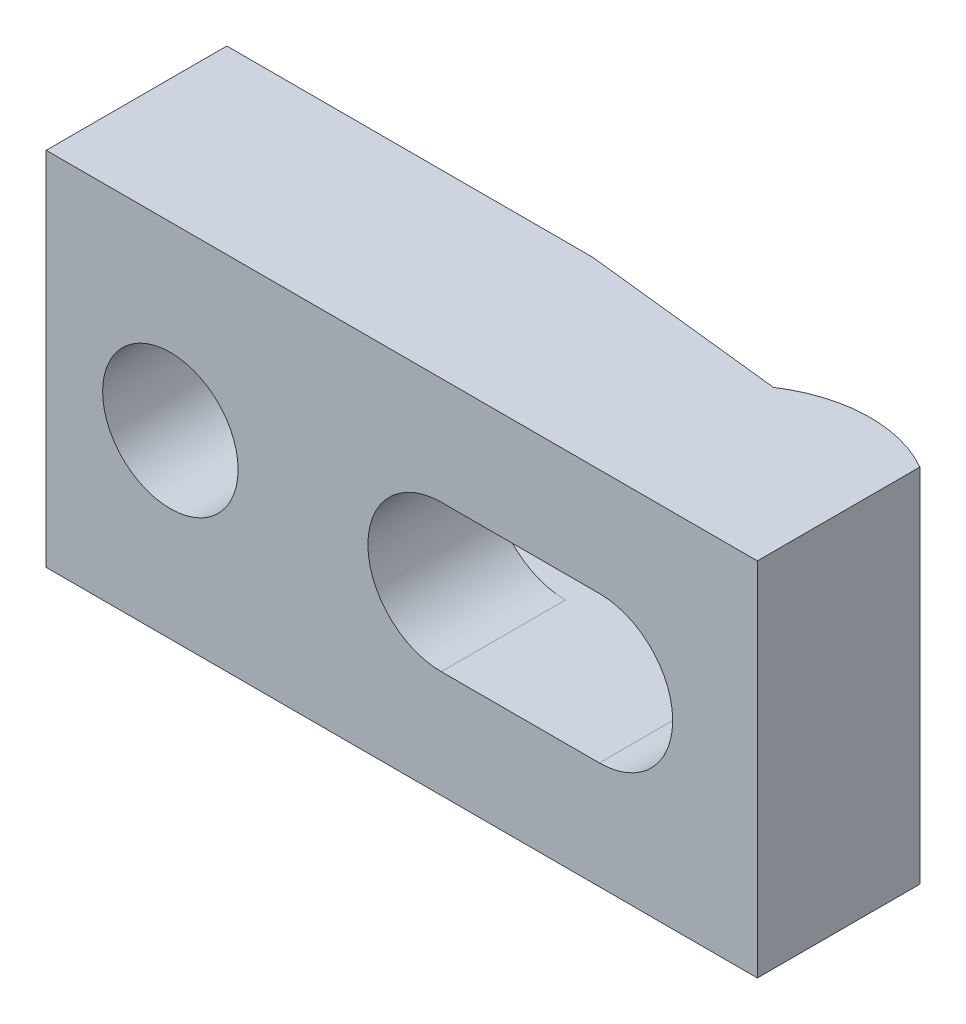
ISO-10303-21;
HEADER;
FILE_DESCRIPTION(('STEP AP214'),'2;1');
FILE_NAME('part.step','',(''),(''),'','','');
FILE_SCHEMA(('AUTOMOTIVE_DESIGN { 1 0 10303 214 1 1 1 1 }'));
ENDSEC;
DATA;
#1=APPLICATION_CONTEXT('core data for automotive mechanical design processes');
#2=APPLICATION_PROTOCOL_DEFINITION('international standard','automotive_design',2000,#1);
#3=PRODUCT_CONTEXT('',#1,'mechanical');
#4=PRODUCT('Part','Part','',(#3));
#5=PRODUCT_RELATED_PRODUCT_CATEGORY('part','',(#4));
#6=PRODUCT_DEFINITION_FORMATION('','',#4);
#7=PRODUCT_DEFINITION_CONTEXT('part definition',#1,'design');
#8=PRODUCT_DEFINITION('design','',#6,#7);
#9=PRODUCT_DEFINITION_SHAPE('','',#8);
#10=(LENGTH_UNIT() NAMED_UNIT(*) SI_UNIT(.MILLI.,.METRE.));
#11=(NAMED_UNIT(*) PLANE_ANGLE_UNIT() SI_UNIT($,.RADIAN.));
#12=(NAMED_UNIT(*) SI_UNIT($,.STERADIAN.) SOLID_ANGLE_UNIT());
#13=UNCERTAINTY_MEASURE_WITH_UNIT(LENGTH_MEASURE(1.E-05),#10,'distance_accuracy_value','');
#14=(GEOMETRIC_REPRESENTATION_CONTEXT(3) GLOBAL_UNCERTAINTY_ASSIGNED_CONTEXT((#13)) GLOBAL_UNIT_ASSIGNED_CONTEXT((#10,
#11,#12)) REPRESENTATION_CONTEXT('',''));
#15=CARTESIAN_POINT('',(0.,0.,0.));
#16=DIRECTION('',(0.,0.,1.));
#17=DIRECTION('',(1.,0.,0.));
#18=AXIS2_PLACEMENT_3D('',#15,#16,#17);
#19=CARTESIAN_POINT('',(-49.,16.,0.));
#20=DIRECTION('',(0.,0.,-1.));
#21=DIRECTION('',(-1.,0.,0.));
#22=AXIS2_PLACEMENT_3D('',#19,#20,#21);
#23=PLANE('',#22);
#24=DIRECTION('',(0.,-1.,0.));
#25=VECTOR('',#24,1.);
#26=CARTESIAN_POINT('',(-16.6,16.,0.));
#27=LINE('',#26,#25);
#28=CARTESIAN_POINT('',(-16.6,16.,0.));
#29=VERTEX_POINT('',#28);
#30=CARTESIAN_POINT('',(-16.6,6.5,0.));
#31=VERTEX_POINT('',#30);
#32=EDGE_CURVE('E143',#29,#31,#27,.T.);
#33=ORIENTED_EDGE('',*,*,#32,.T.);
#34=DIRECTION('',(-1.,0.,0.));
#35=VECTOR('',#34,1.);
#36=CARTESIAN_POINT('',(-6.,6.5,0.));
#37=LINE('',#36,#35);
#38=CARTESIAN_POINT('',(-49.,6.5,0.));
#39=VERTEX_POINT('',#38);
#40=EDGE_CURVE('E137',#31,#39,#37,.T.);
#41=ORIENTED_EDGE('',*,*,#40,.T.);
#42=DIRECTION('',(0.,-1.,0.));
#43=VECTOR('',#42,1.);
#44=CARTESIAN_POINT('',(-49.,16.,0.));
#45=LINE('',#44,#43);
#46=CARTESIAN_POINT('',(-49.,16.,0.));
#47=VERTEX_POINT('',#46);
#48=EDGE_CURVE('E144',#47,#39,#45,.T.);
#49=ORIENTED_EDGE('',*,*,#48,.F.);
#50=DIRECTION('',(1.,0.,0.));
#51=VECTOR('',#50,1.);
#52=CARTESIAN_POINT('',(-49.,16.,0.));
#53=LINE('',#52,#51);
#54=EDGE_CURVE('E173',#47,#29,#53,.T.);
#55=ORIENTED_EDGE('',*,*,#54,.T.);
#56=EDGE_LOOP('',(#33,#41,#49,#55));
#57=FACE_BOUND('',#56,.T.);
#58=ADVANCED_FACE('F14',(#57),#23,.T.);
#59=CARTESIAN_POINT('',(1.4,16.,1.97802414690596));
#60=DIRECTION('',(-0.109232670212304,0.,0.99401620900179));
#61=DIRECTION('',(0.99401620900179,0.,0.109232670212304));
#62=AXIS2_PLACEMENT_3D('',#59,#60,#61);
#63=PLANE('',#62);
#64=DIRECTION('',(-0.99401620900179,0.,-0.109232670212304));
#65=VECTOR('',#64,1.);
#66=CARTESIAN_POINT('',(1.4,6.5,1.97802414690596));
#67=LINE('',#66,#65);
#68=CARTESIAN_POINT('',(0.,6.5,1.82417782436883));
#69=VERTEX_POINT('',#68);
#70=EDGE_CURVE('E23',#69,#31,#67,.T.);
#71=ORIENTED_EDGE('',*,*,#70,.T.);
#72=ORIENTED_EDGE('',*,*,#32,.F.);
#73=DIRECTION('',(-0.99401620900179,0.,-0.109232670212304));
#74=VECTOR('',#73,1.);
#75=CARTESIAN_POINT('',(1.4,16.,1.97802414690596));
#76=LINE('',#75,#74);
#77=CARTESIAN_POINT('',(1.4,16.,1.97802414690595));
#78=VERTEX_POINT('',#77);
#79=EDGE_CURVE('E178',#78,#29,#76,.T.);
#80=ORIENTED_EDGE('',*,*,#79,.F.);
#81=DIRECTION('',(0.,-1.,0.));
#82=VECTOR('',#81,1.);
#83=CARTESIAN_POINT('',(1.4,16.,1.97802414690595));
#84=LINE('',#83,#82);
#85=CARTESIAN_POINT('',(1.4,6.34744042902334,1.97802414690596));
#86=VERTEX_POINT('',#85);
#87=EDGE_CURVE('E152',#78,#86,#84,.T.);
#88=ORIENTED_EDGE('',*,*,#87,.T.);
#89=CARTESIAN_POINT('',(0.,0.,1.82417782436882));
#90=DIRECTION('',(-0.109232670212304,0.,0.99401620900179));
#91=DIRECTION('',(-0.99401620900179,0.,-0.109232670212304));
#92=AXIS2_PLACEMENT_3D('',#89,#90,#91);
#93=ELLIPSE('',#92,6.53912877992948,6.5);
#94=EDGE_CURVE('E9',#69,#86,#93,.F.);
#95=ORIENTED_EDGE('',*,*,#94,.F.);
#96=EDGE_LOOP('',(#71,#72,#80,#88,#95));
#97=FACE_BOUND('',#96,.T.);
#98=ADVANCED_FACE('F160',(#97),#63,.F.);
#99=CARTESIAN_POINT('',(-49.,16.,16.));
#100=DIRECTION('',(-1.,0.,0.));
#101=DIRECTION('',(0.,0.,1.));
#102=AXIS2_PLACEMENT_3D('',#99,#100,#101);
#103=PLANE('',#102);
#104=ORIENTED_EDGE('',*,*,#48,.T.);
#105=DIRECTION('',(0.,0.,1.));
#106=VECTOR('',#105,1.);
#107=CARTESIAN_POINT('',(-49.,6.5,16.));
#108=LINE('',#107,#106);
#109=CARTESIAN_POINT('',(-49.,6.5,5.));
#110=VERTEX_POINT('',#109);
#111=EDGE_CURVE('E168',#39,#110,#108,.T.);
#112=ORIENTED_EDGE('',*,*,#111,.T.);
#113=DIRECTION('',(0.,-1.,0.));
#114=VECTOR('',#113,1.);
#115=CARTESIAN_POINT('',(-49.,16.,5.));
#116=LINE('',#115,#114);
#117=CARTESIAN_POINT('',(-49.,-6.5,5.));
#118=VERTEX_POINT('',#117);
#119=EDGE_CURVE('E279',#110,#118,#116,.T.);
#120=ORIENTED_EDGE('',*,*,#119,.T.);
#121=DIRECTION('',(0.,0.,1.));
#122=VECTOR('',#121,1.);
#123=CARTESIAN_POINT('',(-49.,-6.5,16.));
#124=LINE('',#123,#122);
#125=CARTESIAN_POINT('',(-49.,-6.5,0.));
#126=VERTEX_POINT('',#125);
#127=EDGE_CURVE('E278',#126,#118,#124,.T.);
#128=ORIENTED_EDGE('',*,*,#127,.F.);
#129=CARTESIAN_POINT('',(-49.,-16.,0.));
#130=VERTEX_POINT('',#129);
#131=EDGE_CURVE('E136',#126,#130,#45,.T.);
#132=ORIENTED_EDGE('',*,*,#131,.T.);
#133=DIRECTION('',(0.,0.,-1.));
#134=VECTOR('',#133,1.);
#135=CARTESIAN_POINT('',(-49.,-16.,16.));
#136=LINE('',#135,#134);
#137=CARTESIAN_POINT('',(-49.,-16.,16.));
#138=VERTEX_POINT('',#137);
#139=EDGE_CURVE('E204',#138,#130,#136,.T.);
#140=ORIENTED_EDGE('',*,*,#139,.F.);
#141=DIRECTION('',(0.,-1.,0.));
#142=VECTOR('',#141,1.);
#143=CARTESIAN_POINT('',(-49.,16.,16.));
#144=LINE('',#143,#142);
#145=CARTESIAN_POINT('',(-49.,16.,16.));
#146=VERTEX_POINT('',#145);
#147=EDGE_CURVE('E196',#146,#138,#144,.T.);
#148=ORIENTED_EDGE('',*,*,#147,.F.);
#149=DIRECTION('',(0.,0.,-1.));
#150=VECTOR('',#149,1.);
#151=CARTESIAN_POINT('',(-49.,16.,16.));
#152=LINE('',#151,#150);
#153=EDGE_CURVE('E179',#146,#47,#152,.T.);
#154=ORIENTED_EDGE('',*,*,#153,.T.);
#155=EDGE_LOOP('',(#104,#112,#120,#128,#132,#140,#148,#154));
#156=FACE_BOUND('',#155,.T.);
#157=ADVANCED_FACE('F242',(#156),#103,.T.);
#158=CARTESIAN_POINT('',(-14.,0.,16.));
#159=DIRECTION('',(0.,0.,-1.));
#160=DIRECTION('',(-1.,0.,0.));
#161=AXIS2_PLACEMENT_3D('',#158,#159,#160);
#162=CYLINDRICAL_SURFACE('',#161,6.5);
#163=DIRECTION('',(0.,0.,-1.));
#164=VECTOR('',#163,1.);
#165=CARTESIAN_POINT('',(-14.,-6.5,16.));
#166=LINE('',#165,#164);
#167=CARTESIAN_POINT('',(-14.,-6.5,16.));
#168=VERTEX_POINT('',#167);
#169=CARTESIAN_POINT('',(-14.,-6.5,5.));
#170=VERTEX_POINT('',#169);
#171=EDGE_CURVE('E302',#168,#170,#166,.T.);
#172=ORIENTED_EDGE('',*,*,#171,.T.);
#173=CARTESIAN_POINT('',(-14.,0.,5.));
#174=DIRECTION('',(0.,0.,-1.));
#175=DIRECTION('',(-1.,0.,0.));
#176=AXIS2_PLACEMENT_3D('',#173,#174,#175);
#177=CIRCLE('',#176,6.5);
#178=CARTESIAN_POINT('',(-14.,6.5,5.));
#179=VERTEX_POINT('',#178);
#180=EDGE_CURVE('E285',#170,#179,#177,.T.);
#181=ORIENTED_EDGE('',*,*,#180,.T.);
#182=DIRECTION('',(0.,0.,-1.));
#183=VECTOR('',#182,1.);
#184=CARTESIAN_POINT('',(-14.,6.5,16.));
#185=LINE('',#184,#183);
#186=CARTESIAN_POINT('',(-14.,6.5,16.));
#187=VERTEX_POINT('',#186);
#188=EDGE_CURVE('E303',#187,#179,#185,.T.);
#189=ORIENTED_EDGE('',*,*,#188,.F.);
#190=CARTESIAN_POINT('',(-14.,0.,16.));
#191=DIRECTION('',(0.,0.,1.));
#192=DIRECTION('',(1.,0.,0.));
#193=AXIS2_PLACEMENT_3D('',#190,#191,#192);
#194=CIRCLE('',#193,6.5);
#195=EDGE_CURVE('E40',#187,#168,#194,.T.);
#196=ORIENTED_EDGE('',*,*,#195,.T.);
#197=EDGE_LOOP('',(#172,#181,#189,#196));
#198=FACE_BOUND('',#197,.T.);
#199=ADVANCED_FACE('F239',(#198),#162,.F.);
#200=CARTESIAN_POINT('',(-38.,0.,16.));
#201=DIRECTION('',(0.,0.,-1.));
#202=DIRECTION('',(-1.,0.,0.));
#203=AXIS2_PLACEMENT_3D('',#200,#201,#202);
#204=CYLINDRICAL_SURFACE('',#203,6.);
#205=CARTESIAN_POINT('',(-38.,0.,16.));
#206=DIRECTION('',(0.,0.,1.));
#207=DIRECTION('',(1.,0.,0.));
#208=AXIS2_PLACEMENT_3D('',#205,#206,#207);
#209=CIRCLE('',#208,6.);
#210=CARTESIAN_POINT('',(-32.,0.,16.));
#211=VERTEX_POINT('',#210);
#212=EDGE_CURVE('E283',#211,#211,#209,.T.);
#213=ORIENTED_EDGE('',*,*,#212,.T.);
#214=EDGE_LOOP('',(#213));
#215=FACE_BOUND('',#214,.T.);
#216=CARTESIAN_POINT('',(-38.,0.,5.));
#217=DIRECTION('',(0.,0.,-1.));
#218=DIRECTION('',(-1.,0.,0.));
#219=AXIS2_PLACEMENT_3D('',#216,#217,#218);
#220=CIRCLE('',#219,6.);
#221=CARTESIAN_POINT('',(-44.,0.,5.));
#222=VERTEX_POINT('',#221);
#223=EDGE_CURVE('E18',#222,#222,#220,.T.);
#224=ORIENTED_EDGE('',*,*,#223,.T.);
#225=EDGE_LOOP('',(#224));
#226=FACE_BOUND('',#225,.T.);
#227=ADVANCED_FACE('F234',(#215,#226),#204,.F.);
#228=CARTESIAN_POINT('',(14.,16.,16.));
#229=DIRECTION('',(0.,0.,1.));
#230=DIRECTION('',(1.,0.,0.));
#231=AXIS2_PLACEMENT_3D('',#228,#229,#230);
#232=PLANE('',#231);
#233=DIRECTION('',(1.,0.,0.));
#234=VECTOR('',#233,1.);
#235=CARTESIAN_POINT('',(-14.,6.5,16.));
#236=LINE('',#235,#234);
#237=CARTESIAN_POINT('',(0.,6.5,16.));
#238=VERTEX_POINT('',#237);
#239=EDGE_CURVE('E296',#187,#238,#236,.T.);
#240=ORIENTED_EDGE('',*,*,#239,.T.);
#241=CARTESIAN_POINT('',(0.,0.,16.));
#242=DIRECTION('',(0.,0.,1.));
#243=DIRECTION('',(1.,0.,0.));
#244=AXIS2_PLACEMENT_3D('',#241,#242,#243);
#245=CIRCLE('',#244,6.5);
#246=CARTESIAN_POINT('',(0.,-6.5,16.));
#247=VERTEX_POINT('',#246);
#248=EDGE_CURVE('E291',#247,#238,#245,.T.);
#249=ORIENTED_EDGE('',*,*,#248,.F.);
#250=DIRECTION('',(-1.,0.,0.));
#251=VECTOR('',#250,1.);
#252=CARTESIAN_POINT('',(0.,-6.5,16.));
#253=LINE('',#252,#251);
#254=EDGE_CURVE('E292',#247,#168,#253,.T.);
#255=ORIENTED_EDGE('',*,*,#254,.T.);
#256=ORIENTED_EDGE('',*,*,#195,.F.);
#257=EDGE_LOOP('',(#240,#249,#255,#256));
#258=FACE_BOUND('',#257,.T.);
#259=DIRECTION('',(0.,-1.,0.));
#260=VECTOR('',#259,1.);
#261=CARTESIAN_POINT('',(14.,16.,16.));
#262=LINE('',#261,#260);
#263=CARTESIAN_POINT('',(14.,16.,16.));
#264=VERTEX_POINT('',#263);
#265=CARTESIAN_POINT('',(14.,-16.,16.));
#266=VERTEX_POINT('',#265);
#267=EDGE_CURVE('E128',#264,#266,#262,.T.);
#268=ORIENTED_EDGE('',*,*,#267,.F.);
#269=DIRECTION('',(-1.,0.,0.));
#270=VECTOR('',#269,1.);
#271=CARTESIAN_POINT('',(14.,16.,16.));
#272=LINE('',#271,#270);
#273=EDGE_CURVE('E193',#264,#146,#272,.T.);
#274=ORIENTED_EDGE('',*,*,#273,.T.);
#275=ORIENTED_EDGE('',*,*,#147,.T.);
#276=DIRECTION('',(-1.,0.,0.));
#277=VECTOR('',#276,1.);
#278=CARTESIAN_POINT('',(14.,-16.,16.));
#279=LINE('',#278,#277);
#280=EDGE_CURVE('E202',#266,#138,#279,.T.);
#281=ORIENTED_EDGE('',*,*,#280,.F.);
#282=EDGE_LOOP('',(#268,#274,#275,#281));
#283=FACE_BOUND('',#282,.T.);
#284=ORIENTED_EDGE('',*,*,#212,.F.);
#285=EDGE_LOOP('',(#284));
#286=FACE_BOUND('',#285,.T.);
#287=ADVANCED_FACE('F250',(#258,#283,#286),#232,.T.);
#288=DIRECTION('',(-1.,0.,0.));
#289=VECTOR('',#288,1.);
#290=CARTESIAN_POINT('',(-6.,-6.5,0.));
#291=LINE('',#290,#289);
#292=CARTESIAN_POINT('',(-16.6,-6.5,0.));
#293=VERTEX_POINT('',#292);
#294=EDGE_CURVE('E120',#293,#126,#291,.T.);
#295=ORIENTED_EDGE('',*,*,#294,.F.);
#296=CARTESIAN_POINT('',(-16.6,-16.,0.));
#297=VERTEX_POINT('',#296);
#298=EDGE_CURVE('E134',#293,#297,#27,.T.);
#299=ORIENTED_EDGE('',*,*,#298,.T.);
#300=DIRECTION('',(1.,0.,0.));
#301=VECTOR('',#300,1.);
#302=CARTESIAN_POINT('',(-49.,-16.,0.));
#303=LINE('',#302,#301);
#304=EDGE_CURVE('E208',#130,#297,#303,.T.);
#305=ORIENTED_EDGE('',*,*,#304,.F.);
#306=ORIENTED_EDGE('',*,*,#131,.F.);
#307=EDGE_LOOP('',(#295,#299,#305,#306));
#308=FACE_BOUND('',#307,.T.);
#309=ADVANCED_FACE('F132',(#308),#23,.T.);
#310=CARTESIAN_POINT('',(8.,16.,12.));
#311=DIRECTION('',(0.,-1.,0.));
#312=DIRECTION('',(0.,0.,-1.));
#313=AXIS2_PLACEMENT_3D('',#310,#311,#312);
#314=CYLINDRICAL_SURFACE('',#313,12.);
#315=CARTESIAN_POINT('',(0.0671522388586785,6.49965311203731,2.99611603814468));
#316=CARTESIAN_POINT('',(0.215826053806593,6.49812745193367,2.86508334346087));
#317=CARTESIAN_POINT('',(0.367816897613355,6.49144366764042,2.73775770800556));
#318=CARTESIAN_POINT('',(0.677462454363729,6.46646476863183,2.49108542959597));
#319=CARTESIAN_POINT('',(0.835122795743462,6.44815779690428,2.37174707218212));
#320=CARTESIAN_POINT('',(1.15559960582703,6.39851589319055,2.14133058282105));
#321=CARTESIAN_POINT('',(1.31843727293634,6.36711856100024,2.03029506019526));
#322=CARTESIAN_POINT('',(1.64694286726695,6.29015289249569,1.81781457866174));
#323=CARTESIAN_POINT('',(1.81260983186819,6.24458928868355,1.71636643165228));
#324=CARTESIAN_POINT('',(2.1461537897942,6.13798685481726,1.52288627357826));
#325=CARTESIAN_POINT('',(2.31403814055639,6.07684265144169,1.43092462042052));
#326=CARTESIAN_POINT('',(2.64874527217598,5.93859661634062,1.25757965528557));
#327=CARTESIAN_POINT('',(2.81556793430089,5.86149303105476,1.17619750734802));
#328=CARTESIAN_POINT('',(3.14526201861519,5.69136404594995,1.0243744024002));
#329=CARTESIAN_POINT('',(3.30814444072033,5.59839075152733,0.953899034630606));
#330=CARTESIAN_POINT('',(3.62811472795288,5.39653120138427,0.823396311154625));
#331=CARTESIAN_POINT('',(3.78520346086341,5.28764734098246,0.763367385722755));
#332=CARTESIAN_POINT('',(4.07177999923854,5.06939882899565,0.660279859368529));
#333=CARTESIAN_POINT('',(4.20223606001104,4.96185913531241,0.616033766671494));
#334=CARTESIAN_POINT('',(4.45554484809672,4.73570910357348,0.534637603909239));
#335=CARTESIAN_POINT('',(4.57839779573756,4.61709908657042,0.497487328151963));
#336=CARTESIAN_POINT('',(4.81529957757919,4.36947143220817,0.42965490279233));
#337=CARTESIAN_POINT('',(4.92934040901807,4.24044454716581,0.398978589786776));
#338=CARTESIAN_POINT('',(5.14735332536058,3.97297394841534,0.343453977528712));
#339=CARTESIAN_POINT('',(5.25132523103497,3.83453006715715,0.31860578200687));
#340=CARTESIAN_POINT('',(5.44609738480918,3.55229354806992,0.274500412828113));
#341=CARTESIAN_POINT('',(5.53713283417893,3.40867999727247,0.255134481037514));
#342=CARTESIAN_POINT('',(5.70788257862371,3.11432761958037,0.220620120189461));
#343=CARTESIAN_POINT('',(5.78759305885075,2.96358641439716,0.205473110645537));
#344=CARTESIAN_POINT('',(5.93497959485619,2.65613692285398,0.178777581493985));
#345=CARTESIAN_POINT('',(6.002662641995,2.49943216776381,0.167226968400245));
#346=CARTESIAN_POINT('',(6.12557138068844,2.18094596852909,0.147135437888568));
#347=CARTESIAN_POINT('',(6.18079139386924,2.01916224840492,0.138595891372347));
#348=CARTESIAN_POINT('',(6.2801621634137,1.68552087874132,0.123772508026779));
#349=CARTESIAN_POINT('',(6.3238223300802,1.51351267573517,0.117584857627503));
#350=CARTESIAN_POINT('',(6.39692712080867,1.16651221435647,0.107501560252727));
#351=CARTESIAN_POINT('',(6.42637755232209,0.991521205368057,0.10360497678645));
#352=CARTESIAN_POINT('',(6.47088971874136,0.639581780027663,0.0978015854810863));
#353=CARTESIAN_POINT('',(6.48594302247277,0.462632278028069,0.0958959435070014));
#354=CARTESIAN_POINT('',(6.501520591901,0.108146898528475,0.0939250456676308));
#355=CARTESIAN_POINT('',(6.50204984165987,-0.0693887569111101,0.0938591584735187));
#356=CARTESIAN_POINT('',(6.4884530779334,-0.427447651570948,0.0955774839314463));
#357=CARTESIAN_POINT('',(6.47403383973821,-0.607959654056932,0.0973987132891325));
#358=CARTESIAN_POINT('',(6.43019474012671,-0.967122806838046,0.10310130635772));
#359=CARTESIAN_POINT('',(6.40077462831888,-1.1457739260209,0.106982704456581));
#360=CARTESIAN_POINT('',(6.32716284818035,-1.49990322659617,0.117113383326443));
#361=CARTESIAN_POINT('',(6.28297407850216,-1.67538202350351,0.123362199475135));
#362=CARTESIAN_POINT('',(6.180142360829,-2.02201281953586,0.138683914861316));
#363=CARTESIAN_POINT('',(6.12149301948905,-2.19316286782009,0.147758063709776));
#364=CARTESIAN_POINT('',(5.99031339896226,-2.52956360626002,0.169295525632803));
#365=CARTESIAN_POINT('',(5.91780267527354,-2.69482222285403,0.181754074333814));
#366=CARTESIAN_POINT('',(5.7594959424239,-3.01838151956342,0.210741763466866));
#367=CARTESIAN_POINT('',(5.67370638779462,-3.1766855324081,0.227268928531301));
#368=CARTESIAN_POINT('',(5.48956314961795,-3.48525211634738,0.265157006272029));
#369=CARTESIAN_POINT('',(5.39120681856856,-3.63551298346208,0.28651893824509));
#370=CARTESIAN_POINT('',(5.18288510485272,-3.92680015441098,0.33486858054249));
#371=CARTESIAN_POINT('',(5.07292006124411,-4.06782672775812,0.361856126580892));
#372=CARTESIAN_POINT('',(4.84540232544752,-4.33615453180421,0.421485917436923));
#373=CARTESIAN_POINT('',(4.72810958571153,-4.46371153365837,0.453969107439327));
#374=CARTESIAN_POINT('',(4.4847779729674,-4.70813140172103,0.525711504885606));
#375=CARTESIAN_POINT('',(4.35873927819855,-4.8249944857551,0.564970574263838));
#376=CARTESIAN_POINT('',(4.09941935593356,-5.04716599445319,0.650810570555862));
#377=CARTESIAN_POINT('',(3.96614533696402,-5.15248561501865,0.697384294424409));
#378=CARTESIAN_POINT('',(3.6937498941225,-5.35113304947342,0.798334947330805));
#379=CARTESIAN_POINT('',(3.55462864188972,-5.4444612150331,0.852711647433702));
#380=CARTESIAN_POINT('',(3.27703000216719,-5.61575907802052,0.967533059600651));
#381=CARTESIAN_POINT('',(3.1386974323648,-5.69414898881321,1.02770212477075));
#382=CARTESIAN_POINT('',(2.859521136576,-5.83934024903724,1.15569025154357));
#383=CARTESIAN_POINT('',(2.71867743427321,-5.90614170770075,1.22350924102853));
#384=CARTESIAN_POINT('',(2.43564016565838,-6.02838845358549,1.3668860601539));
#385=CARTESIAN_POINT('',(2.29344458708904,-6.08381254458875,1.44245794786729));
#386=CARTESIAN_POINT('',(2.00929160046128,-6.18347979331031,1.60106287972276));
#387=CARTESIAN_POINT('',(1.8673342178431,-6.2277218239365,1.68409667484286));
#388=CARTESIAN_POINT('',(1.57917311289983,-6.30709458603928,1.86083387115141));
#389=CARTESIAN_POINT('',(1.43302977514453,-6.34178459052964,1.95483293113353));
#390=CARTESIAN_POINT('',(1.14348387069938,-6.40033365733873,2.15019247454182));
#391=CARTESIAN_POINT('',(1.00008202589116,-6.42418990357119,2.25155486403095));
#392=CARTESIAN_POINT('',(0.717583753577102,-6.4618344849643,2.46075657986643));
#393=CARTESIAN_POINT('',(0.578473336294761,-6.47565981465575,2.56857050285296));
#394=CARTESIAN_POINT('',(0.304862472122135,-6.49429461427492,2.79044069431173));
#395=CARTESIAN_POINT('',(0.1703586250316,-6.49911088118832,2.90449218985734));
#396=CARTESIAN_POINT('',(0.0384807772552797,-6.49988609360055,3.02145826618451));
#397=B_SPLINE_CURVE_WITH_KNOTS('',3,(#315,#316,#317,#318,#319,#320,#321,#322,#323,#324,#325,
#326,#327,#328,#329,#330,#331,#332,#333,#334,#335,#336,#337,#338,#339,#340,#341,#342,#343,#344,
#345,#346,#347,#348,#349,#350,#351,#352,#353,#354,#355,#356,#357,#358,#359,#360,#361,#362,#363,
#364,#365,#366,#367,#368,#369,#370,#371,#372,#373,#374,#375,#376,#377,#378,#379,#380,#381,#382,
#383,#384,#385,#386,#387,#388,#389,#390,#391,#392,#393,#394,#395,#396),.UNSPECIFIED.,.F.,.F.,(4,
2,2,2,2,2,2,2,2,2,2,2,2,2,2,2,2,2,2,2,2,2,2,2,2,2,2,2,2,2,2,2,2,2,2,2,2,2,2,2,4),(0.,
0.594531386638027,1.18967024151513,1.78767908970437,2.38548837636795,2.98745329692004,
3.58948439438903,4.18957556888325,4.78957649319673,5.31321307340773,5.83683447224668,
6.36092594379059,6.88502674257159,7.39785505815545,7.91085571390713,8.4235571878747,
8.93649178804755,9.468588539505,10.0004676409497,10.5326580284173,11.0646657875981,
11.6073103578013,12.1499639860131,12.6925111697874,13.2352986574,13.7773259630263,
14.3190906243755,14.8609696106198,15.4028327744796,15.931085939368,16.4593283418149,
16.9870537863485,17.5147637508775,18.024182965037,18.5335973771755,19.0439523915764,
19.554358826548,20.0854025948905,20.6165843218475,21.145796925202,21.6746100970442),.UNSPECIFIED.);
#398=CARTESIAN_POINT('',(1.4,-6.34744042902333,1.97802414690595));
#399=VERTEX_POINT('',#398);
#400=EDGE_CURVE('E205',#86,#399,#397,.T.);
#401=ORIENTED_EDGE('',*,*,#400,.F.);
#402=ORIENTED_EDGE('',*,*,#87,.F.);
#403=CARTESIAN_POINT('',(8.,16.,12.));
#404=DIRECTION('',(0.,1.,0.));
#405=DIRECTION('',(0.,0.,1.));
#406=AXIS2_PLACEMENT_3D('',#403,#404,#405);
#407=CIRCLE('',#406,12.);
#408=CARTESIAN_POINT('',(14.,16.,1.60769515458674));
#409=VERTEX_POINT('',#408);
#410=EDGE_CURVE('E186',#409,#78,#407,.T.);
#411=ORIENTED_EDGE('',*,*,#410,.F.);
#412=DIRECTION('',(0.,-1.,0.));
#413=VECTOR('',#412,1.);
#414=CARTESIAN_POINT('',(14.,16.,1.60769515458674));
#415=LINE('',#414,#413);
#416=CARTESIAN_POINT('',(14.,-16.,1.60769515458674));
#417=VERTEX_POINT('',#416);
#418=EDGE_CURVE('E155',#409,#417,#415,.T.);
#419=ORIENTED_EDGE('',*,*,#418,.T.);
#420=CARTESIAN_POINT('',(8.,-16.,12.));
#421=DIRECTION('',(0.,1.,0.));
#422=DIRECTION('',(0.,0.,1.));
#423=AXIS2_PLACEMENT_3D('',#420,#421,#422);
#424=CIRCLE('',#423,12.);
#425=CARTESIAN_POINT('',(1.4,-16.,1.97802414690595));
#426=VERTEX_POINT('',#425);
#427=EDGE_CURVE('E211',#417,#426,#424,.T.);
#428=ORIENTED_EDGE('',*,*,#427,.T.);
#429=EDGE_CURVE('E147',#399,#426,#84,.T.);
#430=ORIENTED_EDGE('',*,*,#429,.F.);
#431=EDGE_LOOP('',(#401,#402,#411,#419,#428,#430));
#432=FACE_BOUND('',#431,.T.);
#433=ADVANCED_FACE('F224',(#432),#314,.T.);
#434=ORIENTED_EDGE('',*,*,#298,.F.);
#435=DIRECTION('',(0.99401620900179,0.,0.109232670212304));
#436=VECTOR('',#435,1.);
#437=CARTESIAN_POINT('',(1.4,-6.5,1.97802414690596));
#438=LINE('',#437,#436);
#439=CARTESIAN_POINT('',(0.,-6.5,1.82417782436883));
#440=VERTEX_POINT('',#439);
#441=EDGE_CURVE('E117',#293,#440,#438,.T.);
#442=ORIENTED_EDGE('',*,*,#441,.T.);
#443=EDGE_CURVE('E25',#399,#440,#93,.F.);
#444=ORIENTED_EDGE('',*,*,#443,.F.);
#445=ORIENTED_EDGE('',*,*,#429,.T.);
#446=DIRECTION('',(-0.99401620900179,0.,-0.109232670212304));
#447=VECTOR('',#446,1.);
#448=CARTESIAN_POINT('',(1.4,-16.,1.97802414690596));
#449=LINE('',#448,#447);
#450=EDGE_CURVE('E142',#426,#297,#449,.T.);
#451=ORIENTED_EDGE('',*,*,#450,.T.);
#452=EDGE_LOOP('',(#434,#442,#444,#445,#451));
#453=FACE_BOUND('',#452,.T.);
#454=ADVANCED_FACE('F140',(#453),#63,.F.);
#455=CARTESIAN_POINT('',(14.,16.,16.));
#456=DIRECTION('',(-1.,0.,0.));
#457=DIRECTION('',(0.,0.,1.));
#458=AXIS2_PLACEMENT_3D('',#455,#456,#457);
#459=PLANE('',#458);
#460=ORIENTED_EDGE('',*,*,#418,.F.);
#461=DIRECTION('',(0.,0.,-1.));
#462=VECTOR('',#461,1.);
#463=CARTESIAN_POINT('',(14.,16.,16.));
#464=LINE('',#463,#462);
#465=EDGE_CURVE('E188',#264,#409,#464,.T.);
#466=ORIENTED_EDGE('',*,*,#465,.F.);
#467=ORIENTED_EDGE('',*,*,#267,.T.);
#468=DIRECTION('',(0.,0.,-1.));
#469=VECTOR('',#468,1.);
#470=CARTESIAN_POINT('',(14.,-16.,16.));
#471=LINE('',#470,#469);
#472=EDGE_CURVE('E195',#266,#417,#471,.T.);
#473=ORIENTED_EDGE('',*,*,#472,.T.);
#474=EDGE_LOOP('',(#460,#466,#467,#473));
#475=FACE_BOUND('',#474,.T.);
#476=ADVANCED_FACE('F16',(#475),#459,.F.);
#477=CARTESIAN_POINT('',(8.,16.,12.));
#478=DIRECTION('',(0.,1.,0.));
#479=DIRECTION('',(0.,0.,1.));
#480=AXIS2_PLACEMENT_3D('',#477,#478,#479);
#481=PLANE('',#480);
#482=ORIENTED_EDGE('',*,*,#273,.F.);
#483=ORIENTED_EDGE('',*,*,#465,.T.);
#484=ORIENTED_EDGE('',*,*,#410,.T.);
#485=ORIENTED_EDGE('',*,*,#79,.T.);
#486=ORIENTED_EDGE('',*,*,#54,.F.);
#487=ORIENTED_EDGE('',*,*,#153,.F.);
#488=EDGE_LOOP('',(#482,#483,#484,#485,#486,#487));
#489=FACE_BOUND('',#488,.T.);
#490=ADVANCED_FACE('F183',(#489),#481,.T.);
#491=CARTESIAN_POINT('',(8.,-16.,12.));
#492=DIRECTION('',(0.,1.,0.));
#493=DIRECTION('',(0.,0.,1.));
#494=AXIS2_PLACEMENT_3D('',#491,#492,#493);
#495=PLANE('',#494);
#496=ORIENTED_EDGE('',*,*,#280,.T.);
#497=ORIENTED_EDGE('',*,*,#139,.T.);
#498=ORIENTED_EDGE('',*,*,#304,.T.);
#499=ORIENTED_EDGE('',*,*,#450,.F.);
#500=ORIENTED_EDGE('',*,*,#427,.F.);
#501=ORIENTED_EDGE('',*,*,#472,.F.);
#502=EDGE_LOOP('',(#496,#497,#498,#499,#500,#501));
#503=FACE_BOUND('',#502,.T.);
#504=ADVANCED_FACE('F232',(#503),#495,.F.);
#505=CARTESIAN_POINT('',(0.,0.,16.));
#506=DIRECTION('',(0.,0.,-1.));
#507=DIRECTION('',(-1.,0.,0.));
#508=AXIS2_PLACEMENT_3D('',#505,#506,#507);
#509=CYLINDRICAL_SURFACE('',#508,6.5);
#510=ORIENTED_EDGE('',*,*,#94,.T.);
#511=ORIENTED_EDGE('',*,*,#400,.T.);
#512=ORIENTED_EDGE('',*,*,#443,.T.);
#513=DIRECTION('',(0.,0.,-1.));
#514=VECTOR('',#513,1.);
#515=CARTESIAN_POINT('',(0.,-6.5,16.));
#516=LINE('',#515,#514);
#517=EDGE_CURVE('E123',#247,#440,#516,.T.);
#518=ORIENTED_EDGE('',*,*,#517,.F.);
#519=ORIENTED_EDGE('',*,*,#248,.T.);
#520=DIRECTION('',(0.,0.,-1.));
#521=VECTOR('',#520,1.);
#522=CARTESIAN_POINT('',(0.,6.5,16.));
#523=LINE('',#522,#521);
#524=EDGE_CURVE('E222',#238,#69,#523,.T.);
#525=ORIENTED_EDGE('',*,*,#524,.T.);
#526=EDGE_LOOP('',(#510,#511,#512,#518,#519,#525));
#527=FACE_BOUND('',#526,.T.);
#528=ADVANCED_FACE('F227',(#527),#509,.F.);
#529=CARTESIAN_POINT('',(-14.,6.5,16.));
#530=DIRECTION('',(0.,1.,0.));
#531=DIRECTION('',(-1.,0.,0.));
#532=AXIS2_PLACEMENT_3D('',#529,#530,#531);
#533=PLANE('',#532);
#534=ORIENTED_EDGE('',*,*,#40,.F.);
#535=ORIENTED_EDGE('',*,*,#70,.F.);
#536=ORIENTED_EDGE('',*,*,#524,.F.);
#537=ORIENTED_EDGE('',*,*,#239,.F.);
#538=ORIENTED_EDGE('',*,*,#188,.T.);
#539=DIRECTION('',(-1.,0.,0.));
#540=VECTOR('',#539,1.);
#541=CARTESIAN_POINT('',(-6.,6.5,5.));
#542=LINE('',#541,#540);
#543=EDGE_CURVE('E32',#179,#110,#542,.T.);
#544=ORIENTED_EDGE('',*,*,#543,.T.);
#545=ORIENTED_EDGE('',*,*,#111,.F.);
#546=EDGE_LOOP('',(#534,#535,#536,#537,#538,#544,#545));
#547=FACE_BOUND('',#546,.T.);
#548=ADVANCED_FACE('F166',(#547),#533,.F.);
#549=CARTESIAN_POINT('',(0.,-6.5,16.));
#550=DIRECTION('',(0.,-1.,0.));
#551=DIRECTION('',(1.,0.,0.));
#552=AXIS2_PLACEMENT_3D('',#549,#550,#551);
#553=PLANE('',#552);
#554=ORIENTED_EDGE('',*,*,#517,.T.);
#555=ORIENTED_EDGE('',*,*,#441,.F.);
#556=ORIENTED_EDGE('',*,*,#294,.T.);
#557=ORIENTED_EDGE('',*,*,#127,.T.);
#558=DIRECTION('',(-1.,0.,0.));
#559=VECTOR('',#558,1.);
#560=CARTESIAN_POINT('',(-6.,-6.5,5.));
#561=LINE('',#560,#559);
#562=EDGE_CURVE('E170',#170,#118,#561,.T.);
#563=ORIENTED_EDGE('',*,*,#562,.F.);
#564=ORIENTED_EDGE('',*,*,#171,.F.);
#565=ORIENTED_EDGE('',*,*,#254,.F.);
#566=EDGE_LOOP('',(#554,#555,#556,#557,#563,#564,#565));
#567=FACE_BOUND('',#566,.T.);
#568=ADVANCED_FACE('F119',(#567),#553,.F.);
#569=CARTESIAN_POINT('',(-6.,-6.5,5.));
#570=DIRECTION('',(0.,0.,-1.));
#571=DIRECTION('',(-1.,0.,0.));
#572=AXIS2_PLACEMENT_3D('',#569,#570,#571);
#573=PLANE('',#572);
#574=ORIENTED_EDGE('',*,*,#223,.F.);
#575=EDGE_LOOP('',(#574));
#576=FACE_BOUND('',#575,.T.);
#577=ORIENTED_EDGE('',*,*,#543,.F.);
#578=ORIENTED_EDGE('',*,*,#180,.F.);
#579=ORIENTED_EDGE('',*,*,#562,.T.);
#580=ORIENTED_EDGE('',*,*,#119,.F.);
#581=EDGE_LOOP('',(#577,#578,#579,#580));
#582=FACE_BOUND('',#581,.T.);
#583=ADVANCED_FACE('F238',(#576,#582),#573,.T.);
#584=CLOSED_SHELL('',(#58,#98,#157,#199,#227,#287,#309,#433,#454,#476,#490,#504,#528,#548,#568,#583));
#585=MANIFOLD_SOLID_BREP('B1',#584);
#586=ADVANCED_BREP_SHAPE_REPRESENTATION('',(#18,#585),#14);
#587=SHAPE_DEFINITION_REPRESENTATION(#9,#586);
ENDSEC;
END-ISO-10303-21;
